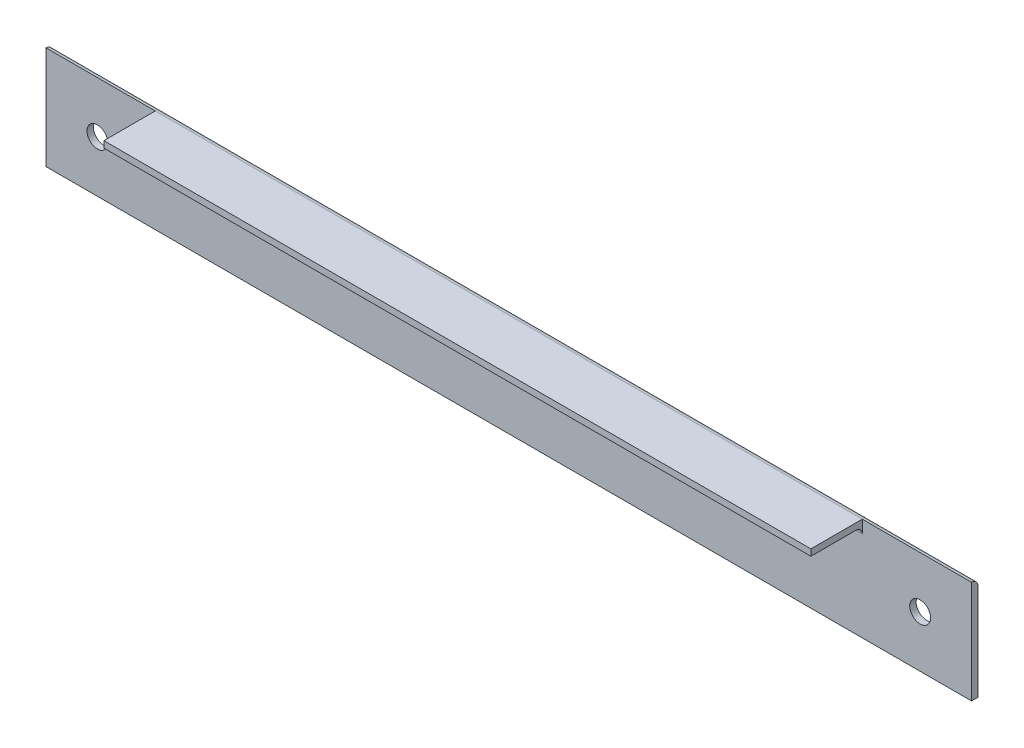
ISO-10303-21;
HEADER;
FILE_DESCRIPTION(('STEP AP214'),'2;1');
FILE_NAME('part.step','',(''),(''),'','','');
FILE_SCHEMA(('AUTOMOTIVE_DESIGN { 1 0 10303 214 1 1 1 1 }'));
ENDSEC;
DATA;
#1=APPLICATION_CONTEXT('core data for automotive mechanical design processes');
#2=APPLICATION_PROTOCOL_DEFINITION('international standard','automotive_design',2000,#1);
#3=PRODUCT_CONTEXT('',#1,'mechanical');
#4=PRODUCT('Part','Part','',(#3));
#5=PRODUCT_RELATED_PRODUCT_CATEGORY('part','',(#4));
#6=PRODUCT_DEFINITION_FORMATION('','',#4);
#7=PRODUCT_DEFINITION_CONTEXT('part definition',#1,'design');
#8=PRODUCT_DEFINITION('design','',#6,#7);
#9=PRODUCT_DEFINITION_SHAPE('','',#8);
#10=(LENGTH_UNIT() NAMED_UNIT(*) SI_UNIT(.MILLI.,.METRE.));
#11=(NAMED_UNIT(*) PLANE_ANGLE_UNIT() SI_UNIT($,.RADIAN.));
#12=(NAMED_UNIT(*) SI_UNIT($,.STERADIAN.) SOLID_ANGLE_UNIT());
#13=UNCERTAINTY_MEASURE_WITH_UNIT(LENGTH_MEASURE(1.E-05),#10,'distance_accuracy_value','');
#14=(GEOMETRIC_REPRESENTATION_CONTEXT(3) GLOBAL_UNCERTAINTY_ASSIGNED_CONTEXT((#13)) GLOBAL_UNIT_ASSIGNED_CONTEXT((#10,
#11,#12)) REPRESENTATION_CONTEXT('',''));
#15=CARTESIAN_POINT('',(0.,0.,0.));
#16=DIRECTION('',(0.,0.,1.));
#17=DIRECTION('',(1.,0.,0.));
#18=AXIS2_PLACEMENT_3D('',#15,#16,#17);
#19=CARTESIAN_POINT('',(0.,-101.6,6.35));
#20=DIRECTION('',(0.,0.,-1.));
#21=DIRECTION('',(-1.,0.,0.));
#22=AXIS2_PLACEMENT_3D('',#19,#20,#21);
#23=PLANE('',#22);
#24=CARTESIAN_POINT('',(-863.6,-50.8,6.35));
#25=DIRECTION('',(0.,0.,1.));
#26=DIRECTION('',(1.,0.,0.));
#27=AXIS2_PLACEMENT_3D('',#24,#25,#26);
#28=CIRCLE('',#27,10.31875);
#29=CARTESIAN_POINT('',(-853.28125,-50.8,6.35));
#30=VERTEX_POINT('',#29);
#31=EDGE_CURVE('E152',#30,#30,#28,.T.);
#32=ORIENTED_EDGE('',*,*,#31,.F.);
#33=EDGE_LOOP('',(#32));
#34=FACE_BOUND('',#33,.T.);
#35=CARTESIAN_POINT('',(-50.8,-50.8,6.35));
#36=DIRECTION('',(0.,0.,1.));
#37=DIRECTION('',(1.,0.,0.));
#38=AXIS2_PLACEMENT_3D('',#35,#36,#37);
#39=CIRCLE('',#38,10.31875);
#40=CARTESIAN_POINT('',(-40.48125,-50.8,6.35));
#41=VERTEX_POINT('',#40);
#42=EDGE_CURVE('E127',#41,#41,#39,.T.);
#43=ORIENTED_EDGE('',*,*,#42,.F.);
#44=EDGE_LOOP('',(#43));
#45=FACE_BOUND('',#44,.T.);
#46=DIRECTION('',(0.,1.,0.));
#47=VECTOR('',#46,1.);
#48=CARTESIAN_POINT('',(-107.95,0.,6.35));
#49=LINE('',#48,#47);
#50=CARTESIAN_POINT('',(-107.95,-12.7,6.35));
#51=VERTEX_POINT('',#50);
#52=CARTESIAN_POINT('',(-107.95,0.,6.35));
#53=VERTEX_POINT('',#52);
#54=EDGE_CURVE('E126',#51,#53,#49,.T.);
#55=ORIENTED_EDGE('',*,*,#54,.F.);
#56=DIRECTION('',(1.,0.,0.));
#57=VECTOR('',#56,1.);
#58=CARTESIAN_POINT('',(-806.45,-12.7,6.35));
#59=LINE('',#58,#57);
#60=CARTESIAN_POINT('',(-806.45,-12.7,6.35));
#61=VERTEX_POINT('',#60);
#62=EDGE_CURVE('E204',#51,#61,#59,.F.);
#63=ORIENTED_EDGE('',*,*,#62,.T.);
#64=DIRECTION('',(0.,-1.,0.));
#65=VECTOR('',#64,1.);
#66=CARTESIAN_POINT('',(-806.45,0.,6.35));
#67=LINE('',#66,#65);
#68=CARTESIAN_POINT('',(-806.45,0.,6.35));
#69=VERTEX_POINT('',#68);
#70=EDGE_CURVE('E122',#69,#61,#67,.T.);
#71=ORIENTED_EDGE('',*,*,#70,.F.);
#72=DIRECTION('',(-1.,0.,0.));
#73=VECTOR('',#72,1.);
#74=CARTESIAN_POINT('',(0.,0.,6.35));
#75=LINE('',#74,#73);
#76=CARTESIAN_POINT('',(-914.4,-1.11978004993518E-13,6.35));
#77=VERTEX_POINT('',#76);
#78=EDGE_CURVE('E163',#69,#77,#75,.T.);
#79=ORIENTED_EDGE('',*,*,#78,.T.);
#80=DIRECTION('',(0.,-1.,0.));
#81=VECTOR('',#80,1.);
#82=CARTESIAN_POINT('',(-914.4,-1.11978004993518E-13,6.35));
#83=LINE('',#82,#81);
#84=CARTESIAN_POINT('',(-914.4,-101.6,6.35));
#85=VERTEX_POINT('',#84);
#86=EDGE_CURVE('E167',#77,#85,#83,.T.);
#87=ORIENTED_EDGE('',*,*,#86,.T.);
#88=DIRECTION('',(1.,0.,0.));
#89=VECTOR('',#88,1.);
#90=CARTESIAN_POINT('',(0.,-101.6,6.35));
#91=LINE('',#90,#89);
#92=CARTESIAN_POINT('',(0.,-101.6,6.35));
#93=VERTEX_POINT('',#92);
#94=EDGE_CURVE('E182',#85,#93,#91,.T.);
#95=ORIENTED_EDGE('',*,*,#94,.T.);
#96=DIRECTION('',(0.,1.,0.));
#97=VECTOR('',#96,1.);
#98=CARTESIAN_POINT('',(0.,0.,6.35));
#99=LINE('',#98,#97);
#100=CARTESIAN_POINT('',(0.,0.,6.35));
#101=VERTEX_POINT('',#100);
#102=EDGE_CURVE('E160',#93,#101,#99,.T.);
#103=ORIENTED_EDGE('',*,*,#102,.T.);
#104=EDGE_CURVE('E173',#101,#53,#75,.T.);
#105=ORIENTED_EDGE('',*,*,#104,.T.);
#106=EDGE_LOOP('',(#55,#63,#71,#79,#87,#95,#103,#105));
#107=FACE_BOUND('',#106,.T.);
#108=ADVANCED_FACE('F30',(#34,#45,#107),#23,.F.);
#109=CARTESIAN_POINT('',(0.,0.,6.35));
#110=DIRECTION('',(-1.,0.,0.));
#111=DIRECTION('',(0.,0.,1.));
#112=AXIS2_PLACEMENT_3D('',#109,#110,#111);
#113=PLANE('',#112);
#114=DIRECTION('',(0.,1.,0.));
#115=VECTOR('',#114,1.);
#116=CARTESIAN_POINT('',(0.,0.,0.));
#117=LINE('',#116,#115);
#118=CARTESIAN_POINT('',(0.,-101.6,0.));
#119=VERTEX_POINT('',#118);
#120=CARTESIAN_POINT('',(0.,-6.35,0.));
#121=VERTEX_POINT('',#120);
#122=EDGE_CURVE('E157',#119,#121,#117,.T.);
#123=ORIENTED_EDGE('',*,*,#122,.T.);
#124=CARTESIAN_POINT('',(0.,-6.35,6.35));
#125=DIRECTION('',(-1.,0.,0.));
#126=DIRECTION('',(0.,0.,1.));
#127=AXIS2_PLACEMENT_3D('',#124,#125,#126);
#128=CIRCLE('',#127,6.35);
#129=EDGE_CURVE('E200',#121,#101,#128,.F.);
#130=ORIENTED_EDGE('',*,*,#129,.T.);
#131=ORIENTED_EDGE('',*,*,#102,.F.);
#132=DIRECTION('',(0.,0.,-1.));
#133=VECTOR('',#132,1.);
#134=CARTESIAN_POINT('',(0.,-101.6,6.35));
#135=LINE('',#134,#133);
#136=EDGE_CURVE('E179',#93,#119,#135,.T.);
#137=ORIENTED_EDGE('',*,*,#136,.T.);
#138=EDGE_LOOP('',(#123,#130,#131,#137));
#139=FACE_BOUND('',#138,.T.);
#140=ADVANCED_FACE('F198',(#139),#113,.F.);
#141=CARTESIAN_POINT('',(0.,0.,6.35));
#142=DIRECTION('',(0.,-1.,0.));
#143=DIRECTION('',(1.,0.,0.));
#144=AXIS2_PLACEMENT_3D('',#141,#142,#143);
#145=PLANE('',#144);
#146=DIRECTION('',(0.,0.,-1.));
#147=VECTOR('',#146,1.);
#148=CARTESIAN_POINT('',(-107.95,0.,57.15));
#149=LINE('',#148,#147);
#150=CARTESIAN_POINT('',(-107.95,0.,57.15));
#151=VERTEX_POINT('',#150);
#152=EDGE_CURVE('E106',#151,#53,#149,.T.);
#153=ORIENTED_EDGE('',*,*,#152,.T.);
#154=DIRECTION('',(-1.,0.,0.));
#155=VECTOR('',#154,1.);
#156=CARTESIAN_POINT('',(-914.4,-1.11978004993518E-13,6.35));
#157=LINE('',#156,#155);
#158=EDGE_CURVE('E203',#53,#69,#157,.T.);
#159=ORIENTED_EDGE('',*,*,#158,.T.);
#160=DIRECTION('',(0.,0.,-1.));
#161=VECTOR('',#160,1.);
#162=CARTESIAN_POINT('',(-806.45,0.,57.15));
#163=LINE('',#162,#161);
#164=CARTESIAN_POINT('',(-806.45,0.,57.15));
#165=VERTEX_POINT('',#164);
#166=EDGE_CURVE('E109',#165,#69,#163,.T.);
#167=ORIENTED_EDGE('',*,*,#166,.F.);
#168=DIRECTION('',(-1.,0.,0.));
#169=VECTOR('',#168,1.);
#170=CARTESIAN_POINT('',(-107.95,0.,57.15));
#171=LINE('',#170,#169);
#172=EDGE_CURVE('E102',#151,#165,#171,.T.);
#173=ORIENTED_EDGE('',*,*,#172,.F.);
#174=EDGE_LOOP('',(#153,#159,#167,#173));
#175=FACE_BOUND('',#174,.T.);
#176=ADVANCED_FACE('F104',(#175),#145,.F.);
#177=CARTESIAN_POINT('',(-914.4,-1.11978004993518E-13,6.35));
#178=DIRECTION('',(1.,0.,0.));
#179=DIRECTION('',(0.,0.,-1.));
#180=AXIS2_PLACEMENT_3D('',#177,#178,#179);
#181=PLANE('',#180);
#182=ORIENTED_EDGE('',*,*,#86,.F.);
#183=CARTESIAN_POINT('',(-914.4,-6.35000000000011,6.35));
#184=DIRECTION('',(1.,0.,0.));
#185=DIRECTION('',(0.,0.,-1.));
#186=AXIS2_PLACEMENT_3D('',#183,#184,#185);
#187=CIRCLE('',#186,6.35);
#188=CARTESIAN_POINT('',(-914.4,-6.35000000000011,0.));
#189=VERTEX_POINT('',#188);
#190=EDGE_CURVE('E53',#77,#189,#187,.F.);
#191=ORIENTED_EDGE('',*,*,#190,.T.);
#192=DIRECTION('',(0.,-1.,0.));
#193=VECTOR('',#192,1.);
#194=CARTESIAN_POINT('',(-914.4,-1.11978004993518E-13,0.));
#195=LINE('',#194,#193);
#196=CARTESIAN_POINT('',(-914.4,-101.6,0.));
#197=VERTEX_POINT('',#196);
#198=EDGE_CURVE('E184',#189,#197,#195,.T.);
#199=ORIENTED_EDGE('',*,*,#198,.T.);
#200=DIRECTION('',(0.,0.,-1.));
#201=VECTOR('',#200,1.);
#202=CARTESIAN_POINT('',(-914.4,-101.6,6.35));
#203=LINE('',#202,#201);
#204=EDGE_CURVE('E176',#85,#197,#203,.T.);
#205=ORIENTED_EDGE('',*,*,#204,.F.);
#206=EDGE_LOOP('',(#182,#191,#199,#205));
#207=FACE_BOUND('',#206,.T.);
#208=ADVANCED_FACE('F192',(#207),#181,.F.);
#209=CARTESIAN_POINT('',(0.,-101.6,6.35));
#210=DIRECTION('',(0.,1.,0.));
#211=DIRECTION('',(-1.,0.,0.));
#212=AXIS2_PLACEMENT_3D('',#209,#210,#211);
#213=PLANE('',#212);
#214=DIRECTION('',(1.,0.,0.));
#215=VECTOR('',#214,1.);
#216=CARTESIAN_POINT('',(0.,-101.6,0.));
#217=LINE('',#216,#215);
#218=EDGE_CURVE('E164',#197,#119,#217,.T.);
#219=ORIENTED_EDGE('',*,*,#218,.T.);
#220=ORIENTED_EDGE('',*,*,#136,.F.);
#221=ORIENTED_EDGE('',*,*,#94,.F.);
#222=ORIENTED_EDGE('',*,*,#204,.T.);
#223=EDGE_LOOP('',(#219,#220,#221,#222));
#224=FACE_BOUND('',#223,.T.);
#225=ADVANCED_FACE('F195',(#224),#213,.F.);
#226=CARTESIAN_POINT('',(0.,-101.6,0.));
#227=DIRECTION('',(0.,0.,-1.));
#228=DIRECTION('',(-1.,0.,0.));
#229=AXIS2_PLACEMENT_3D('',#226,#227,#228);
#230=PLANE('',#229);
#231=CARTESIAN_POINT('',(-50.8,-50.8,0.));
#232=DIRECTION('',(0.,0.,1.));
#233=DIRECTION('',(1.,0.,0.));
#234=AXIS2_PLACEMENT_3D('',#231,#232,#233);
#235=CIRCLE('',#234,10.31875);
#236=CARTESIAN_POINT('',(-40.48125,-50.8,0.));
#237=VERTEX_POINT('',#236);
#238=EDGE_CURVE('E130',#237,#237,#235,.T.);
#239=ORIENTED_EDGE('',*,*,#238,.T.);
#240=EDGE_LOOP('',(#239));
#241=FACE_BOUND('',#240,.T.);
#242=CARTESIAN_POINT('',(-863.6,-50.8,0.));
#243=DIRECTION('',(0.,0.,1.));
#244=DIRECTION('',(1.,0.,0.));
#245=AXIS2_PLACEMENT_3D('',#242,#243,#244);
#246=CIRCLE('',#245,10.31875);
#247=CARTESIAN_POINT('',(-853.28125,-50.8,0.));
#248=VERTEX_POINT('',#247);
#249=EDGE_CURVE('E154',#248,#248,#246,.T.);
#250=ORIENTED_EDGE('',*,*,#249,.T.);
#251=EDGE_LOOP('',(#250));
#252=FACE_BOUND('',#251,.T.);
#253=ORIENTED_EDGE('',*,*,#198,.F.);
#254=DIRECTION('',(-1.,0.,0.));
#255=VECTOR('',#254,1.);
#256=CARTESIAN_POINT('',(0.,-6.35,0.));
#257=LINE('',#256,#255);
#258=EDGE_CURVE('E45',#189,#121,#257,.F.);
#259=ORIENTED_EDGE('',*,*,#258,.T.);
#260=ORIENTED_EDGE('',*,*,#122,.F.);
#261=ORIENTED_EDGE('',*,*,#218,.F.);
#262=EDGE_LOOP('',(#253,#259,#260,#261));
#263=FACE_BOUND('',#262,.T.);
#264=ADVANCED_FACE('F244',(#241,#252,#263),#230,.T.);
#265=CARTESIAN_POINT('',(-863.6,-50.8,0.));
#266=DIRECTION('',(0.,0.,1.));
#267=DIRECTION('',(1.,0.,0.));
#268=AXIS2_PLACEMENT_3D('',#265,#266,#267);
#269=CYLINDRICAL_SURFACE('',#268,10.31875);
#270=ORIENTED_EDGE('',*,*,#249,.F.);
#271=EDGE_LOOP('',(#270));
#272=FACE_BOUND('',#271,.T.);
#273=ORIENTED_EDGE('',*,*,#31,.T.);
#274=EDGE_LOOP('',(#273));
#275=FACE_BOUND('',#274,.T.);
#276=ADVANCED_FACE('F242',(#272,#275),#269,.F.);
#277=CARTESIAN_POINT('',(-50.8,-50.8,0.));
#278=DIRECTION('',(0.,0.,1.));
#279=DIRECTION('',(1.,0.,0.));
#280=AXIS2_PLACEMENT_3D('',#277,#278,#279);
#281=CYLINDRICAL_SURFACE('',#280,10.31875);
#282=ORIENTED_EDGE('',*,*,#238,.F.);
#283=EDGE_LOOP('',(#282));
#284=FACE_BOUND('',#283,.T.);
#285=ORIENTED_EDGE('',*,*,#42,.T.);
#286=EDGE_LOOP('',(#285));
#287=FACE_BOUND('',#286,.T.);
#288=ADVANCED_FACE('F283',(#284,#287),#281,.F.);
#289=CARTESIAN_POINT('',(-107.95,0.,57.15));
#290=DIRECTION('',(-1.,0.,0.));
#291=DIRECTION('',(0.,0.,1.));
#292=AXIS2_PLACEMENT_3D('',#289,#290,#291);
#293=PLANE('',#292);
#294=ORIENTED_EDGE('',*,*,#54,.T.);
#295=ORIENTED_EDGE('',*,*,#152,.F.);
#296=DIRECTION('',(0.,1.,0.));
#297=VECTOR('',#296,1.);
#298=CARTESIAN_POINT('',(-107.95,0.,57.15));
#299=LINE('',#298,#297);
#300=CARTESIAN_POINT('',(-107.95,-6.35,57.15));
#301=VERTEX_POINT('',#300);
#302=EDGE_CURVE('E113',#301,#151,#299,.T.);
#303=ORIENTED_EDGE('',*,*,#302,.F.);
#304=DIRECTION('',(0.,0.,-1.));
#305=VECTOR('',#304,1.);
#306=CARTESIAN_POINT('',(-107.95,-6.35,57.15));
#307=LINE('',#306,#305);
#308=CARTESIAN_POINT('',(-107.95,-6.35,12.7));
#309=VERTEX_POINT('',#308);
#310=EDGE_CURVE('E147',#301,#309,#307,.T.);
#311=ORIENTED_EDGE('',*,*,#310,.T.);
#312=CARTESIAN_POINT('',(-107.95,-12.7,12.7));
#313=DIRECTION('',(-1.,0.,0.));
#314=DIRECTION('',(0.,0.,1.));
#315=AXIS2_PLACEMENT_3D('',#312,#313,#314);
#316=CIRCLE('',#315,6.35);
#317=EDGE_CURVE('E38',#309,#51,#316,.T.);
#318=ORIENTED_EDGE('',*,*,#317,.T.);
#319=EDGE_LOOP('',(#294,#295,#303,#311,#318));
#320=FACE_BOUND('',#319,.T.);
#321=ADVANCED_FACE('F124',(#320),#293,.F.);
#322=CARTESIAN_POINT('',(-806.45,0.,57.15));
#323=DIRECTION('',(1.,0.,0.));
#324=DIRECTION('',(0.,0.,-1.));
#325=AXIS2_PLACEMENT_3D('',#322,#323,#324);
#326=PLANE('',#325);
#327=ORIENTED_EDGE('',*,*,#70,.T.);
#328=CARTESIAN_POINT('',(-806.45,-12.7,12.7));
#329=DIRECTION('',(1.,0.,0.));
#330=DIRECTION('',(0.,0.,-1.));
#331=AXIS2_PLACEMENT_3D('',#328,#329,#330);
#332=CIRCLE('',#331,6.35);
#333=CARTESIAN_POINT('',(-806.45,-6.35,12.7));
#334=VERTEX_POINT('',#333);
#335=EDGE_CURVE('E11',#61,#334,#332,.T.);
#336=ORIENTED_EDGE('',*,*,#335,.T.);
#337=DIRECTION('',(0.,0.,-1.));
#338=VECTOR('',#337,1.);
#339=CARTESIAN_POINT('',(-806.45,-6.35,57.15));
#340=LINE('',#339,#338);
#341=CARTESIAN_POINT('',(-806.45,-6.35,57.15));
#342=VERTEX_POINT('',#341);
#343=EDGE_CURVE('E132',#342,#334,#340,.T.);
#344=ORIENTED_EDGE('',*,*,#343,.F.);
#345=DIRECTION('',(0.,-1.,0.));
#346=VECTOR('',#345,1.);
#347=CARTESIAN_POINT('',(-806.45,0.,57.15));
#348=LINE('',#347,#346);
#349=EDGE_CURVE('E112',#165,#342,#348,.T.);
#350=ORIENTED_EDGE('',*,*,#349,.F.);
#351=ORIENTED_EDGE('',*,*,#166,.T.);
#352=EDGE_LOOP('',(#327,#336,#344,#350,#351));
#353=FACE_BOUND('',#352,.T.);
#354=ADVANCED_FACE('F219',(#353),#326,.F.);
#355=CARTESIAN_POINT('',(-107.95,-6.35,57.15));
#356=DIRECTION('',(0.,1.,0.));
#357=DIRECTION('',(0.,0.,1.));
#358=AXIS2_PLACEMENT_3D('',#355,#356,#357);
#359=PLANE('',#358);
#360=ORIENTED_EDGE('',*,*,#343,.T.);
#361=DIRECTION('',(1.,0.,0.));
#362=VECTOR('',#361,1.);
#363=CARTESIAN_POINT('',(-107.95,-6.35,12.7));
#364=LINE('',#363,#362);
#365=EDGE_CURVE('E141',#334,#309,#364,.T.);
#366=ORIENTED_EDGE('',*,*,#365,.T.);
#367=ORIENTED_EDGE('',*,*,#310,.F.);
#368=DIRECTION('',(1.,0.,0.));
#369=VECTOR('',#368,1.);
#370=CARTESIAN_POINT('',(-107.95,-6.35,57.15));
#371=LINE('',#370,#369);
#372=EDGE_CURVE('E118',#342,#301,#371,.T.);
#373=ORIENTED_EDGE('',*,*,#372,.F.);
#374=EDGE_LOOP('',(#360,#366,#367,#373));
#375=FACE_BOUND('',#374,.T.);
#376=ADVANCED_FACE('F222',(#375),#359,.F.);
#377=CARTESIAN_POINT('',(-107.95,-6.35,57.15));
#378=DIRECTION('',(0.,0.,-1.));
#379=DIRECTION('',(-1.,0.,0.));
#380=AXIS2_PLACEMENT_3D('',#377,#378,#379);
#381=PLANE('',#380);
#382=ORIENTED_EDGE('',*,*,#302,.T.);
#383=ORIENTED_EDGE('',*,*,#172,.T.);
#384=ORIENTED_EDGE('',*,*,#349,.T.);
#385=ORIENTED_EDGE('',*,*,#372,.T.);
#386=EDGE_LOOP('',(#382,#383,#384,#385));
#387=FACE_BOUND('',#386,.T.);
#388=ADVANCED_FACE('F116',(#387),#381,.F.);
#389=CARTESIAN_POINT('',(-107.95,-12.7,12.7));
#390=DIRECTION('',(-1.,0.,0.));
#391=DIRECTION('',(0.,0.,1.));
#392=AXIS2_PLACEMENT_3D('',#389,#390,#391);
#393=CYLINDRICAL_SURFACE('',#392,6.35);
#394=ORIENTED_EDGE('',*,*,#335,.F.);
#395=ORIENTED_EDGE('',*,*,#62,.F.);
#396=ORIENTED_EDGE('',*,*,#317,.F.);
#397=ORIENTED_EDGE('',*,*,#365,.F.);
#398=EDGE_LOOP('',(#394,#395,#396,#397));
#399=FACE_BOUND('',#398,.T.);
#400=ADVANCED_FACE('F217',(#399),#393,.F.);
#401=CARTESIAN_POINT('',(0.,-6.35,6.35));
#402=DIRECTION('',(1.,0.,0.));
#403=DIRECTION('',(0.,1.,0.));
#404=AXIS2_PLACEMENT_3D('',#401,#402,#403);
#405=CYLINDRICAL_SURFACE('',#404,6.35);
#406=ORIENTED_EDGE('',*,*,#129,.F.);
#407=ORIENTED_EDGE('',*,*,#258,.F.);
#408=ORIENTED_EDGE('',*,*,#190,.F.);
#409=ORIENTED_EDGE('',*,*,#78,.F.);
#410=ORIENTED_EDGE('',*,*,#158,.F.);
#411=ORIENTED_EDGE('',*,*,#104,.F.);
#412=EDGE_LOOP('',(#406,#407,#408,#409,#410,#411));
#413=FACE_BOUND('',#412,.T.);
#414=ADVANCED_FACE('F32',(#413),#405,.T.);
#415=CLOSED_SHELL('',(#108,#140,#176,#208,#225,#264,#276,#288,#321,#354,#376,#388,#400,#414));
#416=MANIFOLD_SOLID_BREP('B2',#415);
#417=ADVANCED_BREP_SHAPE_REPRESENTATION('',(#18,#416),#14);
#418=SHAPE_DEFINITION_REPRESENTATION(#9,#417);
ENDSEC;
END-ISO-10303-21;
